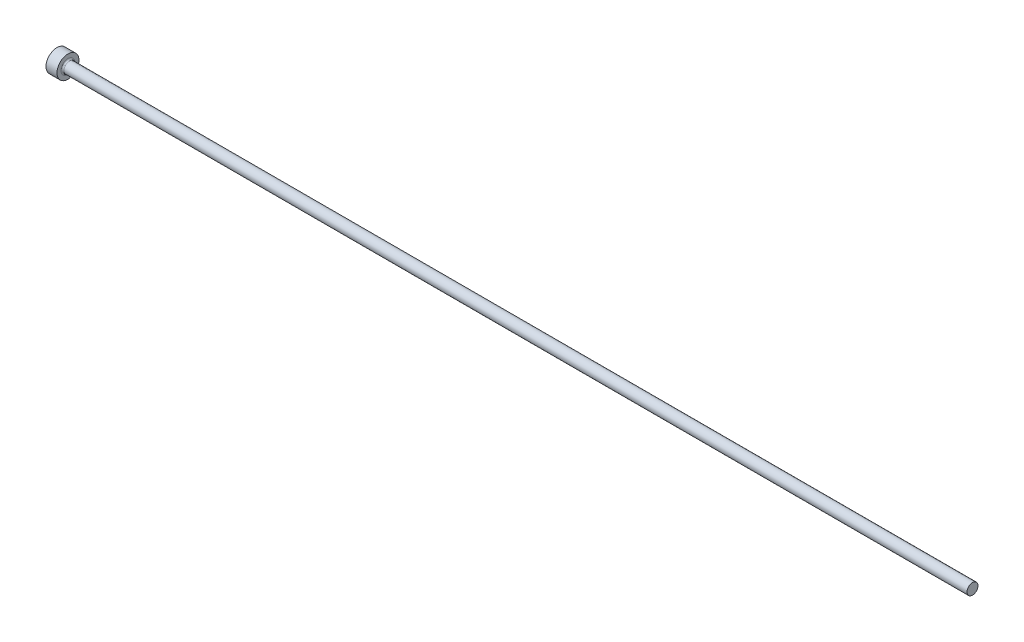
ISO-10303-21;
HEADER;
FILE_DESCRIPTION(('STEP AP214'),'2;1');
FILE_NAME('part.step','',(''),(''),'','','');
FILE_SCHEMA(('AUTOMOTIVE_DESIGN { 1 0 10303 214 1 1 1 1 }'));
ENDSEC;
DATA;
#1=APPLICATION_CONTEXT('core data for automotive mechanical design processes');
#2=APPLICATION_PROTOCOL_DEFINITION('international standard','automotive_design',2000,#1);
#3=PRODUCT_CONTEXT('',#1,'mechanical');
#4=PRODUCT('Part','Part','',(#3));
#5=PRODUCT_RELATED_PRODUCT_CATEGORY('part','',(#4));
#6=PRODUCT_DEFINITION_FORMATION('','',#4);
#7=PRODUCT_DEFINITION_CONTEXT('part definition',#1,'design');
#8=PRODUCT_DEFINITION('design','',#6,#7);
#9=PRODUCT_DEFINITION_SHAPE('','',#8);
#10=(LENGTH_UNIT() NAMED_UNIT(*) SI_UNIT(.MILLI.,.METRE.));
#11=(NAMED_UNIT(*) PLANE_ANGLE_UNIT() SI_UNIT($,.RADIAN.));
#12=(NAMED_UNIT(*) SI_UNIT($,.STERADIAN.) SOLID_ANGLE_UNIT());
#13=UNCERTAINTY_MEASURE_WITH_UNIT(LENGTH_MEASURE(1.E-05),#10,'distance_accuracy_value','');
#14=(GEOMETRIC_REPRESENTATION_CONTEXT(3) GLOBAL_UNCERTAINTY_ASSIGNED_CONTEXT((#13)) GLOBAL_UNIT_ASSIGNED_CONTEXT((#10,
#11,#12)) REPRESENTATION_CONTEXT('',''));
#15=CARTESIAN_POINT('',(0.,0.,0.));
#16=DIRECTION('',(0.,0.,1.));
#17=DIRECTION('',(1.,0.,0.));
#18=AXIS2_PLACEMENT_3D('',#15,#16,#17);
#19=CARTESIAN_POINT('',(0.,0.,0.));
#20=DIRECTION('',(-1.,0.,0.));
#21=DIRECTION('',(0.,-1.,0.));
#22=AXIS2_PLACEMENT_3D('',#19,#20,#21);
#23=PLANE('',#22);
#24=CARTESIAN_POINT('',(0.,0.,0.));
#25=DIRECTION('',(1.,0.,0.));
#26=DIRECTION('',(0.,1.,0.));
#27=AXIS2_PLACEMENT_3D('',#24,#25,#26);
#28=CIRCLE('',#27,1.5);
#29=CARTESIAN_POINT('',(0.,1.5,0.));
#30=VERTEX_POINT('',#29);
#31=EDGE_CURVE('E25',#30,#30,#28,.T.);
#32=ORIENTED_EDGE('',*,*,#31,.F.);
#33=EDGE_LOOP('',(#32));
#34=FACE_BOUND('',#33,.T.);
#35=ADVANCED_FACE('F14',(#34),#23,.T.);
#36=CARTESIAN_POINT('',(125.,0.,0.));
#37=DIRECTION('',(1.,0.,0.));
#38=DIRECTION('',(0.,1.,0.));
#39=AXIS2_PLACEMENT_3D('',#36,#37,#38);
#40=CYLINDRICAL_SURFACE('',#39,1.5);
#41=ORIENTED_EDGE('',*,*,#31,.T.);
#42=EDGE_LOOP('',(#41));
#43=FACE_BOUND('',#42,.T.);
#44=CARTESIAN_POINT('',(1.5,0.,0.));
#45=DIRECTION('',(1.,0.,0.));
#46=DIRECTION('',(0.,1.,0.));
#47=AXIS2_PLACEMENT_3D('',#44,#45,#46);
#48=CIRCLE('',#47,1.5);
#49=CARTESIAN_POINT('',(1.5,1.5,0.));
#50=VERTEX_POINT('',#49);
#51=EDGE_CURVE('E29',#50,#50,#48,.T.);
#52=ORIENTED_EDGE('',*,*,#51,.F.);
#53=EDGE_LOOP('',(#52));
#54=FACE_BOUND('',#53,.T.);
#55=ADVANCED_FACE('F51',(#43,#54),#40,.T.);
#56=CARTESIAN_POINT('',(1.5,1.5,0.));
#57=DIRECTION('',(1.,0.,0.));
#58=DIRECTION('',(0.,1.,0.));
#59=AXIS2_PLACEMENT_3D('',#56,#57,#58);
#60=PLANE('',#59);
#61=CARTESIAN_POINT('',(1.5,0.,0.));
#62=DIRECTION('',(1.,0.,0.));
#63=DIRECTION('',(0.,1.,0.));
#64=AXIS2_PLACEMENT_3D('',#61,#62,#63);
#65=CIRCLE('',#64,0.94999999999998);
#66=CARTESIAN_POINT('',(1.5,0.94999999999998,0.));
#67=VERTEX_POINT('',#66);
#68=EDGE_CURVE('E9',#67,#67,#65,.F.);
#69=ORIENTED_EDGE('',*,*,#68,.T.);
#70=EDGE_LOOP('',(#69));
#71=FACE_BOUND('',#70,.T.);
#72=ORIENTED_EDGE('',*,*,#51,.T.);
#73=EDGE_LOOP('',(#72));
#74=FACE_BOUND('',#73,.T.);
#75=ADVANCED_FACE('F42',(#71,#74),#60,.T.);
#76=CARTESIAN_POINT('',(125.,0.,0.));
#77=DIRECTION('',(1.,0.,0.));
#78=DIRECTION('',(0.,1.,0.));
#79=AXIS2_PLACEMENT_3D('',#76,#77,#78);
#80=CYLINDRICAL_SURFACE('',#79,0.74999999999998);
#81=CARTESIAN_POINT('',(1.7,0.,0.));
#82=DIRECTION('',(1.,0.,0.));
#83=DIRECTION('',(0.,1.,0.));
#84=AXIS2_PLACEMENT_3D('',#81,#82,#83);
#85=CIRCLE('',#84,0.74999999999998);
#86=CARTESIAN_POINT('',(1.7,0.74999999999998,0.));
#87=VERTEX_POINT('',#86);
#88=EDGE_CURVE('E21',#87,#87,#85,.T.);
#89=ORIENTED_EDGE('',*,*,#88,.T.);
#90=EDGE_LOOP('',(#89));
#91=FACE_BOUND('',#90,.T.);
#92=CARTESIAN_POINT('',(125.,0.,0.));
#93=DIRECTION('',(1.,0.,0.));
#94=DIRECTION('',(0.,1.,0.));
#95=AXIS2_PLACEMENT_3D('',#92,#93,#94);
#96=CIRCLE('',#95,0.749999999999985);
#97=CARTESIAN_POINT('',(125.,0.749999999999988,0.));
#98=VERTEX_POINT('',#97);
#99=EDGE_CURVE('E34',#98,#98,#96,.T.);
#100=ORIENTED_EDGE('',*,*,#99,.F.);
#101=EDGE_LOOP('',(#100));
#102=FACE_BOUND('',#101,.T.);
#103=ADVANCED_FACE('F40',(#91,#102),#80,.T.);
#104=CARTESIAN_POINT('',(125.,0.749999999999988,0.));
#105=DIRECTION('',(1.,0.,0.));
#106=DIRECTION('',(0.,1.,0.));
#107=AXIS2_PLACEMENT_3D('',#104,#105,#106);
#108=PLANE('',#107);
#109=ORIENTED_EDGE('',*,*,#99,.T.);
#110=EDGE_LOOP('',(#109));
#111=FACE_BOUND('',#110,.T.);
#112=ADVANCED_FACE('F38',(#111),#108,.T.);
#113=CARTESIAN_POINT('',(1.7,0.,0.));
#114=DIRECTION('',(1.,0.,0.));
#115=DIRECTION('',(0.,1.,0.));
#116=AXIS2_PLACEMENT_3D('',#113,#114,#115);
#117=TOROIDAL_SURFACE('',#116,0.94999999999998,0.2);
#118=ORIENTED_EDGE('',*,*,#68,.F.);
#119=EDGE_LOOP('',(#118));
#120=FACE_BOUND('',#119,.T.);
#121=ORIENTED_EDGE('',*,*,#88,.F.);
#122=EDGE_LOOP('',(#121));
#123=FACE_BOUND('',#122,.T.);
#124=ADVANCED_FACE('F16',(#120,#123),#117,.F.);
#125=CLOSED_SHELL('',(#35,#55,#75,#103,#112,#124));
#126=MANIFOLD_SOLID_BREP('B1',#125);
#127=ADVANCED_BREP_SHAPE_REPRESENTATION('',(#18,#126),#14);
#128=SHAPE_DEFINITION_REPRESENTATION(#9,#127);
ENDSEC;
END-ISO-10303-21;
